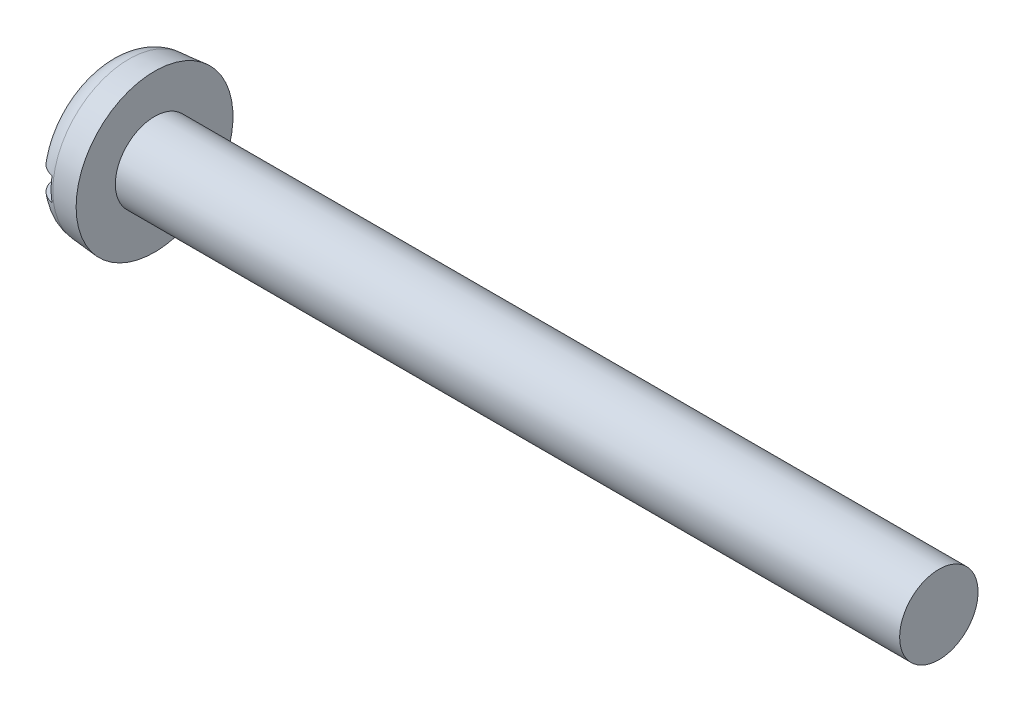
from build123d import *

# Parameters (mm, degrees)
FILLET2_R  = 1.2
SKETCH2_W  = 8
SKETCH2_H  = 1.2
SLOT_DEPTH = 1


with BuildPart() as part:
    # BodySke → Base-Revolve (revolve)
    with BuildSketch(Plane.XY, mode=Mode.PRIVATE) as base_revolve_sk:
        Polygon((2.4, 2), (2.4, 4), (0, 3.790027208), (0, 0), (42.4, 0), (42.4, 2), align=None)
    revolve(base_revolve_sk.sketch.rotate(Axis((-25.4, 0, 0), (1, 0, 0)), 90), axis=Axis((-25.4, 0, 0), (1, 0, 0)))

    # Fillet2
    fillet2_edges = [part.edges().sort_by_distance(p)[0] for p in [
        (0, 0, -3.790027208),
    ]]
    fillet(fillet2_edges, radius=FILLET2_R)

    # Sketch2 → Slot (cut)
    with BuildSketch(Plane(origin=(0, 0, 0), x_dir=(0, 0, -1), z_dir=(1, 0, 0))):
        Rectangle(SKETCH2_W, SKETCH2_H)
    extrude(amount=SLOT_DEPTH, mode=Mode.SUBTRACT)


solid = part.part
